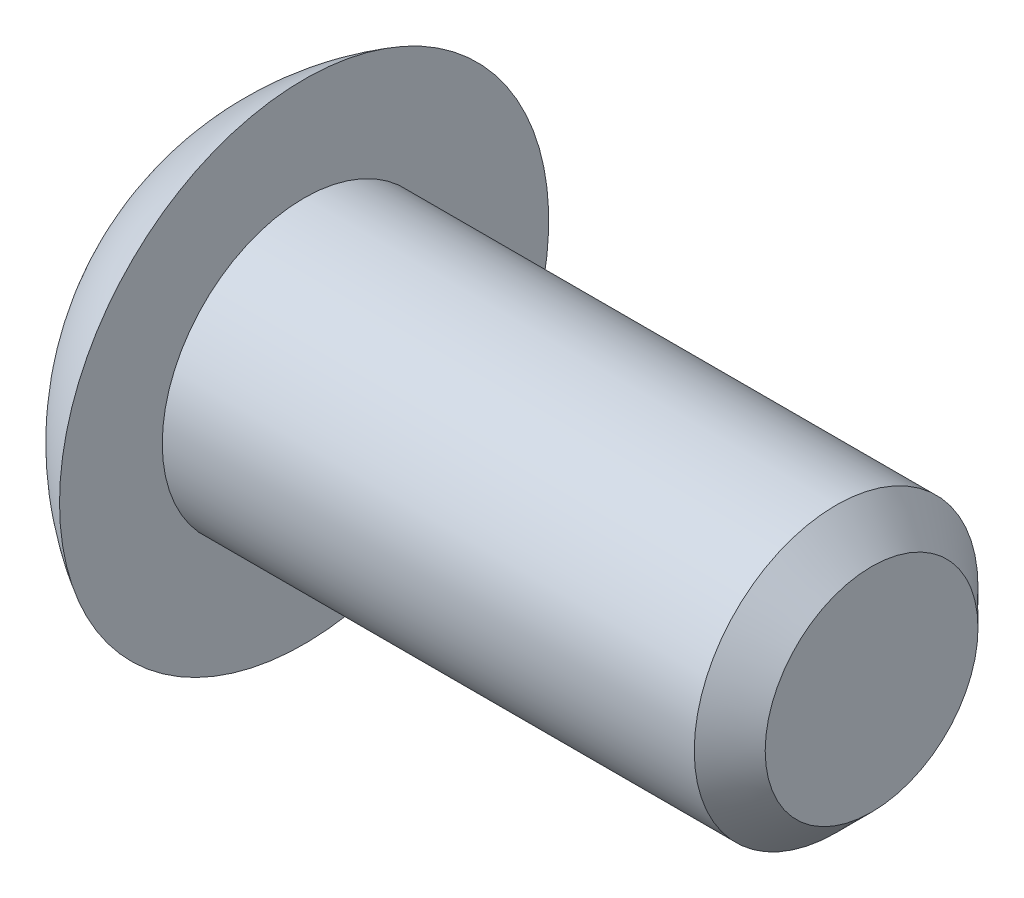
ISO-10303-21;
HEADER;
FILE_DESCRIPTION(('STEP AP214'),'2;1');
FILE_NAME('part.step','',(''),(''),'','','');
FILE_SCHEMA(('AUTOMOTIVE_DESIGN { 1 0 10303 214 1 1 1 1 }'));
ENDSEC;
DATA;
#1=APPLICATION_CONTEXT('core data for automotive mechanical design processes');
#2=APPLICATION_PROTOCOL_DEFINITION('international standard','automotive_design',2000,#1);
#3=PRODUCT_CONTEXT('',#1,'mechanical');
#4=PRODUCT('Part','Part','',(#3));
#5=PRODUCT_RELATED_PRODUCT_CATEGORY('part','',(#4));
#6=PRODUCT_DEFINITION_FORMATION('','',#4);
#7=PRODUCT_DEFINITION_CONTEXT('part definition',#1,'design');
#8=PRODUCT_DEFINITION('design','',#6,#7);
#9=PRODUCT_DEFINITION_SHAPE('','',#8);
#10=(LENGTH_UNIT() NAMED_UNIT(*) SI_UNIT(.MILLI.,.METRE.));
#11=(NAMED_UNIT(*) PLANE_ANGLE_UNIT() SI_UNIT($,.RADIAN.));
#12=(NAMED_UNIT(*) SI_UNIT($,.STERADIAN.) SOLID_ANGLE_UNIT());
#13=UNCERTAINTY_MEASURE_WITH_UNIT(LENGTH_MEASURE(1.E-05),#10,'distance_accuracy_value','');
#14=(GEOMETRIC_REPRESENTATION_CONTEXT(3) GLOBAL_UNCERTAINTY_ASSIGNED_CONTEXT((#13)) GLOBAL_UNIT_ASSIGNED_CONTEXT((#10,
#11,#12)) REPRESENTATION_CONTEXT('',''));
#15=CARTESIAN_POINT('',(0.,0.,0.));
#16=DIRECTION('',(0.,0.,1.));
#17=DIRECTION('',(1.,0.,0.));
#18=AXIS2_PLACEMENT_3D('',#15,#16,#17);
#19=CARTESIAN_POINT('',(-42.8371930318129,0.000128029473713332,0.));
#20=DIRECTION('',(-1.,0.,0.));
#21=DIRECTION('',(0.,0.,1.));
#22=AXIS2_PLACEMENT_3D('',#19,#20,#21);
#23=CYLINDRICAL_SURFACE('',#22,2.);
#24=CARTESIAN_POINT('',(-33.3371930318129,0.000128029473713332,0.));
#25=DIRECTION('',(-1.,0.,0.));
#26=DIRECTION('',(0.,0.,1.));
#27=AXIS2_PLACEMENT_3D('',#24,#25,#26);
#28=CIRCLE('',#27,2.);
#29=CARTESIAN_POINT('',(-33.3371930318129,0.000128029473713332,2.));
#30=VERTEX_POINT('',#29);
#31=EDGE_CURVE('E38',#30,#30,#28,.T.);
#32=ORIENTED_EDGE('',*,*,#31,.T.);
#33=EDGE_LOOP('',(#32));
#34=FACE_BOUND('',#33,.T.);
#35=CARTESIAN_POINT('',(-40.8371930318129,0.000128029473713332,0.));
#36=DIRECTION('',(-1.,0.,0.));
#37=DIRECTION('',(0.,0.,1.));
#38=AXIS2_PLACEMENT_3D('',#35,#36,#37);
#39=CIRCLE('',#38,2.);
#40=CARTESIAN_POINT('',(-40.8371930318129,0.000128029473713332,2.));
#41=VERTEX_POINT('',#40);
#42=EDGE_CURVE('E51',#41,#41,#39,.T.);
#43=ORIENTED_EDGE('',*,*,#42,.F.);
#44=EDGE_LOOP('',(#43));
#45=FACE_BOUND('',#44,.T.);
#46=ADVANCED_FACE('F31',(#34,#45),#23,.T.);
#47=CARTESIAN_POINT('',(-40.8371930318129,2.00012802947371,0.));
#48=DIRECTION('',(-1.,0.,0.));
#49=DIRECTION('',(0.,0.,1.));
#50=AXIS2_PLACEMENT_3D('',#47,#48,#49);
#51=PLANE('',#50);
#52=CARTESIAN_POINT('',(-40.8371930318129,0.000128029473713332,0.));
#53=DIRECTION('',(-1.,0.,0.));
#54=DIRECTION('',(0.,0.,1.));
#55=AXIS2_PLACEMENT_3D('',#52,#53,#54);
#56=CIRCLE('',#55,3.44828534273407);
#57=CARTESIAN_POINT('',(-40.8371930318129,0.000128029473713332,3.44828534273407));
#58=VERTEX_POINT('',#57);
#59=EDGE_CURVE('E49',#58,#58,#56,.T.);
#60=ORIENTED_EDGE('',*,*,#59,.F.);
#61=EDGE_LOOP('',(#60));
#62=FACE_BOUND('',#61,.T.);
#63=ORIENTED_EDGE('',*,*,#42,.T.);
#64=EDGE_LOOP('',(#63));
#65=FACE_BOUND('',#64,.T.);
#66=ADVANCED_FACE('F45',(#62,#65),#51,.F.);
#67=CARTESIAN_POINT('',(-38.8372243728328,0.000128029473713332,-0.0158343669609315));
#68=DIRECTION('',(0.,-1.,0.));
#69=DIRECTION('',(0.,0.,1.));
#70=AXIS2_PLACEMENT_3D('',#67,#68,#69);
#71=CIRCLE('',#70,4.);
#72=TRIMMED_CURVE('',#71,(PARAMETER_VALUE(-1.56683772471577)),
(PARAMETER_VALUE(1.56683772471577)),.T.,.PARAMETER.);
#73=CARTESIAN_POINT('',(-38.8372243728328,0.000128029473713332,0.));
#74=DIRECTION('',(-1.,0.,0.));
#75=AXIS1_PLACEMENT('',#73,#74);
#76=SURFACE_OF_REVOLUTION('',#72,#75);
#77=CARTESIAN_POINT('',(-42.8371930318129,0.000128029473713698,0.));
#78=VERTEX_POINT('',#77);
#79=VERTEX_LOOP('',#78);
#80=FACE_BOUND('',#79,.T.);
#81=ORIENTED_EDGE('',*,*,#59,.T.);
#82=EDGE_LOOP('',(#81));
#83=FACE_BOUND('',#82,.T.);
#84=ADVANCED_FACE('F41',(#80,#83),#76,.T.);
#85=CARTESIAN_POINT('',(-32.8371930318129,2.00012802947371,0.));
#86=DIRECTION('',(-1.,0.,0.));
#87=DIRECTION('',(0.,0.,1.));
#88=AXIS2_PLACEMENT_3D('',#85,#86,#87);
#89=PLANE('',#88);
#90=CARTESIAN_POINT('',(-32.8371930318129,0.000128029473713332,0.));
#91=DIRECTION('',(-1.,0.,0.));
#92=DIRECTION('',(0.,0.,1.));
#93=AXIS2_PLACEMENT_3D('',#90,#91,#92);
#94=CIRCLE('',#93,1.5);
#95=CARTESIAN_POINT('',(-32.8371930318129,0.000128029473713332,1.5));
#96=VERTEX_POINT('',#95);
#97=EDGE_CURVE('E11',#96,#96,#94,.F.);
#98=ORIENTED_EDGE('',*,*,#97,.T.);
#99=EDGE_LOOP('',(#98));
#100=FACE_BOUND('',#99,.T.);
#101=ADVANCED_FACE('F44',(#100),#89,.F.);
#102=CARTESIAN_POINT('',(-33.3371930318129,0.000128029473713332,0.));
#103=DIRECTION('',(-1.,0.,0.));
#104=DIRECTION('',(0.,0.,1.));
#105=AXIS2_PLACEMENT_3D('',#102,#103,#104);
#106=CONICAL_SURFACE('',#105,2.,0.785398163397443);
#107=ORIENTED_EDGE('',*,*,#97,.F.);
#108=EDGE_LOOP('',(#107));
#109=FACE_BOUND('',#108,.T.);
#110=ORIENTED_EDGE('',*,*,#31,.F.);
#111=EDGE_LOOP('',(#110));
#112=FACE_BOUND('',#111,.T.);
#113=ADVANCED_FACE('F33',(#109,#112),#106,.T.);
#114=CLOSED_SHELL('',(#46,#66,#84,#101,#113));
#115=MANIFOLD_SOLID_BREP('B2',#114);
#116=ADVANCED_BREP_SHAPE_REPRESENTATION('',(#18,#115),#14);
#117=SHAPE_DEFINITION_REPRESENTATION(#9,#116);
ENDSEC;
END-ISO-10303-21;
